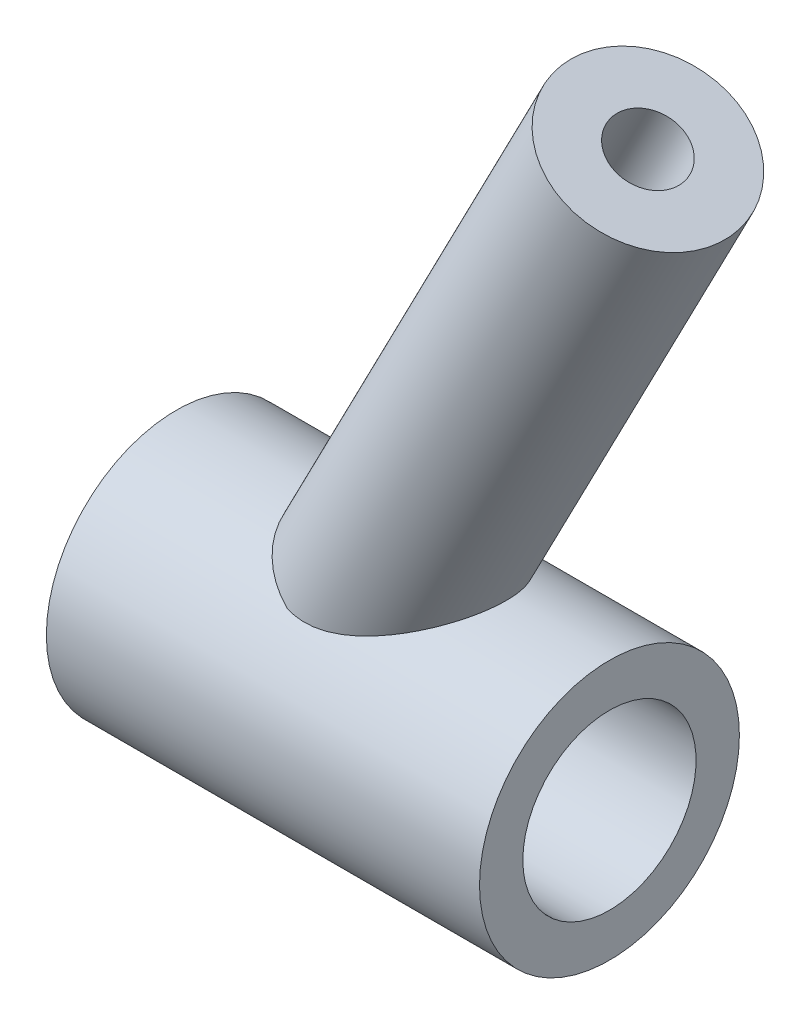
ISO-10303-21;
HEADER;
FILE_DESCRIPTION(('STEP AP214'),'2;1');
FILE_NAME('part.step','',(''),(''),'','','');
FILE_SCHEMA(('AUTOMOTIVE_DESIGN { 1 0 10303 214 1 1 1 1 }'));
ENDSEC;
DATA;
#1=APPLICATION_CONTEXT('core data for automotive mechanical design processes');
#2=APPLICATION_PROTOCOL_DEFINITION('international standard','automotive_design',2000,#1);
#3=PRODUCT_CONTEXT('',#1,'mechanical');
#4=PRODUCT('Part','Part','',(#3));
#5=PRODUCT_RELATED_PRODUCT_CATEGORY('part','',(#4));
#6=PRODUCT_DEFINITION_FORMATION('','',#4);
#7=PRODUCT_DEFINITION_CONTEXT('part definition',#1,'design');
#8=PRODUCT_DEFINITION('design','',#6,#7);
#9=PRODUCT_DEFINITION_SHAPE('','',#8);
#10=(LENGTH_UNIT() NAMED_UNIT(*) SI_UNIT(.MILLI.,.METRE.));
#11=(NAMED_UNIT(*) PLANE_ANGLE_UNIT() SI_UNIT($,.RADIAN.));
#12=(NAMED_UNIT(*) SI_UNIT($,.STERADIAN.) SOLID_ANGLE_UNIT());
#13=UNCERTAINTY_MEASURE_WITH_UNIT(LENGTH_MEASURE(1.E-05),#10,'distance_accuracy_value','');
#14=(GEOMETRIC_REPRESENTATION_CONTEXT(3) GLOBAL_UNCERTAINTY_ASSIGNED_CONTEXT((#13)) GLOBAL_UNIT_ASSIGNED_CONTEXT((#10,
#11,#12)) REPRESENTATION_CONTEXT('',''));
#15=CARTESIAN_POINT('',(0.,0.,0.));
#16=DIRECTION('',(0.,0.,1.));
#17=DIRECTION('',(1.,0.,0.));
#18=AXIS2_PLACEMENT_3D('',#15,#16,#17);
#19=CARTESIAN_POINT('',(0.,0.,0.));
#20=DIRECTION('',(-1.,0.,0.));
#21=DIRECTION('',(0.,0.,1.));
#22=AXIS2_PLACEMENT_3D('',#19,#20,#21);
#23=CYLINDRICAL_SURFACE('',#22,1.);
#24=CARTESIAN_POINT('',(1.90391969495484,0.,0.));
#25=DIRECTION('',(-0.519513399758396,0.854462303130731,0.));
#26=DIRECTION('',(-0.854462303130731,-0.519513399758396,0.));
#27=AXIS2_PLACEMENT_3D('',#24,#25,#26);
#28=ELLIPSE('',#27,1.92487816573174,1.);
#29=CARTESIAN_POINT('',(3.07510411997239,0.712080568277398,0.702097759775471));
#30=VERTEX_POINT('',#29);
#31=CARTESIAN_POINT('',(3.07510411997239,0.712080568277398,-0.702097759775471));
#32=VERTEX_POINT('',#31);
#33=EDGE_CURVE('E74',#30,#32,#28,.T.);
#34=ORIENTED_EDGE('',*,*,#33,.T.);
#35=CARTESIAN_POINT('',(4.44880184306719,0.,0.));
#36=DIRECTION('',(-0.460211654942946,-0.88780923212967,0.));
#37=DIRECTION('',(-0.88780923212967,0.460211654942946,0.));
#38=AXIS2_PLACEMENT_3D('',#35,#36,#37);
#39=ELLIPSE('',#38,2.17291324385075,1.);
#40=EDGE_CURVE('E133',#32,#30,#39,.F.);
#41=ORIENTED_EDGE('',*,*,#40,.T.);
#42=EDGE_LOOP('',(#34,#41));
#43=FACE_BOUND('',#42,.T.);
#44=CARTESIAN_POINT('',(5.,0.,0.));
#45=DIRECTION('',(-1.,0.,0.));
#46=DIRECTION('',(0.,0.,1.));
#47=AXIS2_PLACEMENT_3D('',#44,#45,#46);
#48=CIRCLE('',#47,1.);
#49=CARTESIAN_POINT('',(5.,0.,1.));
#50=VERTEX_POINT('',#49);
#51=EDGE_CURVE('E123',#50,#50,#48,.T.);
#52=ORIENTED_EDGE('',*,*,#51,.F.);
#53=EDGE_LOOP('',(#52));
#54=FACE_BOUND('',#53,.T.);
#55=CARTESIAN_POINT('',(0.,0.,0.));
#56=DIRECTION('',(-1.,0.,0.));
#57=DIRECTION('',(0.,0.,1.));
#58=AXIS2_PLACEMENT_3D('',#55,#56,#57);
#59=CIRCLE('',#58,0.999999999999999);
#60=CARTESIAN_POINT('',(0.,0.,0.999999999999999));
#61=VERTEX_POINT('',#60);
#62=EDGE_CURVE('E77',#61,#61,#59,.T.);
#63=ORIENTED_EDGE('',*,*,#62,.T.);
#64=EDGE_LOOP('',(#63));
#65=FACE_BOUND('',#64,.T.);
#66=ADVANCED_FACE('F32',(#43,#54,#65),#23,.F.);
#67=CARTESIAN_POINT('',(0.,0.999999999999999,0.));
#68=DIRECTION('',(1.,0.,0.));
#69=DIRECTION('',(0.,0.,-1.));
#70=AXIS2_PLACEMENT_3D('',#67,#68,#69);
#71=PLANE('',#70);
#72=ORIENTED_EDGE('',*,*,#62,.F.);
#73=EDGE_LOOP('',(#72));
#74=FACE_BOUND('',#73,.T.);
#75=CARTESIAN_POINT('',(0.,0.,0.));
#76=DIRECTION('',(-1.,0.,0.));
#77=DIRECTION('',(0.,0.,1.));
#78=AXIS2_PLACEMENT_3D('',#75,#76,#77);
#79=CIRCLE('',#78,1.5);
#80=CARTESIAN_POINT('',(0.,0.,1.5));
#81=VERTEX_POINT('',#80);
#82=EDGE_CURVE('E79',#81,#81,#79,.T.);
#83=ORIENTED_EDGE('',*,*,#82,.T.);
#84=EDGE_LOOP('',(#83));
#85=FACE_BOUND('',#84,.T.);
#86=ADVANCED_FACE('F108',(#74,#85),#71,.F.);
#87=CARTESIAN_POINT('',(0.,0.,0.));
#88=DIRECTION('',(-1.,0.,0.));
#89=DIRECTION('',(0.,0.,1.));
#90=AXIS2_PLACEMENT_3D('',#87,#88,#89);
#91=CYLINDRICAL_SURFACE('',#90,1.5);
#92=CARTESIAN_POINT('',(4.44880184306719,0.,0.));
#93=DIRECTION('',(-0.460211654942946,-0.88780923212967,0.));
#94=DIRECTION('',(-0.88780923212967,0.460211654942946,0.));
#95=AXIS2_PLACEMENT_3D('',#92,#93,#94);
#96=ELLIPSE('',#95,3.25936986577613,1.5);
#97=CARTESIAN_POINT('',(2.25273620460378,1.1383695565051,0.976787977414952));
#98=VERTEX_POINT('',#97);
#99=CARTESIAN_POINT('',(1.5551031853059,1.5,0.));
#100=VERTEX_POINT('',#99);
#101=EDGE_CURVE('E35',#98,#100,#96,.T.);
#102=ORIENTED_EDGE('',*,*,#101,.T.);
#103=CARTESIAN_POINT('',(2.25273620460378,1.1383695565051,-0.976787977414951));
#104=VERTEX_POINT('',#103);
#105=EDGE_CURVE('E11',#100,#104,#96,.T.);
#106=ORIENTED_EDGE('',*,*,#105,.T.);
#107=CARTESIAN_POINT('',(2.25273620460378,1.1383695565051,-0.976787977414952));
#108=CARTESIAN_POINT('',(2.27961917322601,1.13343787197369,-0.982523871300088));
#109=CARTESIAN_POINT('',(2.30688108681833,1.12941772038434,-0.98713381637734));
#110=CARTESIAN_POINT('',(2.36182423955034,1.12317956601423,-0.994230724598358));
#111=CARTESIAN_POINT('',(2.38950442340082,1.12095761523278,-0.996722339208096));
#112=CARTESIAN_POINT('',(2.47198384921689,1.11697313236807,-1.00119532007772));
#113=CARTESIAN_POINT('',(2.52707302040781,1.11774171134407,-1.00034316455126));
#114=CARTESIAN_POINT('',(2.65318723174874,1.12598788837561,-0.991057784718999));
#115=CARTESIAN_POINT('',(2.72387890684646,1.13546435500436,-0.980364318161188));
#116=CARTESIAN_POINT('',(2.86267198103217,1.16081177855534,-0.950209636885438));
#117=CARTESIAN_POINT('',(2.93074619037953,1.17673651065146,-0.930674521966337));
#118=CARTESIAN_POINT('',(3.03995402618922,1.20612245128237,-0.891984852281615));
#119=CARTESIAN_POINT('',(3.08220300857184,1.21850571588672,-0.875073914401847));
#120=CARTESIAN_POINT('',(3.16493883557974,1.24431243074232,-0.837972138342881));
#121=CARTESIAN_POINT('',(3.20542487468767,1.25773634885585,-0.817779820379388));
#122=CARTESIAN_POINT('',(3.28423067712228,1.28506346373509,-0.774127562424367));
#123=CARTESIAN_POINT('',(3.32255743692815,1.29896484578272,-0.750679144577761));
#124=CARTESIAN_POINT('',(3.39680303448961,1.3268034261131,-0.700300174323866));
#125=CARTESIAN_POINT('',(3.43272367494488,1.34074058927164,-0.673372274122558));
#126=CARTESIAN_POINT('',(3.50672327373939,1.37017810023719,-0.611517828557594));
#127=CARTESIAN_POINT('',(3.54434163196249,1.38560656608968,-0.575997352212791));
#128=CARTESIAN_POINT('',(3.61442243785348,1.41493989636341,-0.499613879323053));
#129=CARTESIAN_POINT('',(3.64689159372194,1.42884673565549,-0.458757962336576));
#130=CARTESIAN_POINT('',(3.69854371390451,1.45127516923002,-0.380880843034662));
#131=CARTESIAN_POINT('',(3.71908262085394,1.4603120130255,-0.344917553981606));
#132=CARTESIAN_POINT('',(3.75453971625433,1.47602721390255,-0.269827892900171));
#133=CARTESIAN_POINT('',(3.76946597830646,1.48270895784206,-0.230706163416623));
#134=CARTESIAN_POINT('',(3.79064763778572,1.49222671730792,-0.156330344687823));
#135=CARTESIAN_POINT('',(3.79788766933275,1.49549796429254,-0.121415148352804));
#136=CARTESIAN_POINT('',(3.80686687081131,1.49955819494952,-0.0507435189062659));
#137=CARTESIAN_POINT('',(3.80860938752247,1.50034868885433,-0.0149876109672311));
#138=CARTESIAN_POINT('',(3.80644062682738,1.49936654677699,0.0563216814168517));
#139=CARTESIAN_POINT('',(3.80252794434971,1.49759327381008,0.0918750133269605));
#140=CARTESIAN_POINT('',(3.78939101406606,1.49166409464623,0.161779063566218));
#141=CARTESIAN_POINT('',(3.78016277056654,1.48750639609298,0.196128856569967));
#142=CARTESIAN_POINT('',(3.75396126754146,1.47577693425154,0.271882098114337));
#143=CARTESIAN_POINT('',(3.73557224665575,1.46758759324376,0.312696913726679));
#144=CARTESIAN_POINT('',(3.69293370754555,1.44882803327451,0.390524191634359));
#145=CARTESIAN_POINT('',(3.66867374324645,1.43825357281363,0.427529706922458));
#146=CARTESIAN_POINT('',(3.60323436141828,1.4101823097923,0.51412639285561));
#147=CARTESIAN_POINT('',(3.55946481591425,1.39176943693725,0.56144704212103));
#148=CARTESIAN_POINT('',(3.46530962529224,1.35349037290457,0.648325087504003));
#149=CARTESIAN_POINT('',(3.41490551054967,1.33362019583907,0.68786001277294));
#150=CARTESIAN_POINT('',(3.32482174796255,1.29979435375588,0.74924729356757));
#151=CARTESIAN_POINT('',(3.28634102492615,1.28581585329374,0.772882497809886));
#152=CARTESIAN_POINT('',(3.20731035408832,1.25837052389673,0.81680793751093));
#153=CARTESIAN_POINT('',(3.16675927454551,1.24490398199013,0.83709631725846));
#154=CARTESIAN_POINT('',(3.08385572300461,1.21899848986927,0.874389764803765));
#155=CARTESIAN_POINT('',(3.04150315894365,1.20655959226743,0.891394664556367));
#156=CARTESIAN_POINT('',(2.95520035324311,1.18329699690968,0.922051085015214));
#157=CARTESIAN_POINT('',(2.91125114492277,1.17247227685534,0.935704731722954));
#158=CARTESIAN_POINT('',(2.81126289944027,1.15081591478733,0.962279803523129));
#159=CARTESIAN_POINT('',(2.75483080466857,1.14059278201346,0.974257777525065));
#160=CARTESIAN_POINT('',(2.64053509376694,1.12533031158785,0.991853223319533));
#161=CARTESIAN_POINT('',(2.58268128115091,1.12026222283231,0.99750599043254));
#162=CARTESIAN_POINT('',(2.47908123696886,1.11733525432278,1.00078268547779));
#163=CARTESIAN_POINT('',(2.43343473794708,1.11814955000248,0.999883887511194));
#164=CARTESIAN_POINT('',(2.36531721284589,1.12296140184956,0.994465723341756));
#165=CARTESIAN_POINT('',(2.34254819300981,1.12518565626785,0.991956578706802));
#166=CARTESIAN_POINT('',(2.29734436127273,1.13085778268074,0.985483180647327));
#167=CARTESIAN_POINT('',(2.27490999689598,1.13430716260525,0.981517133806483));
#168=CARTESIAN_POINT('',(2.25273620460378,1.1383695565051,0.976787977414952));
#169=B_SPLINE_CURVE_WITH_KNOTS('',3,(#107,#108,#109,#110,#111,#112,#113,#114,#115,#116,#117,
#118,#119,#120,#121,#122,#123,#124,#125,#126,#127,#128,#129,#130,#131,#132,#133,#134,#135,#136,
#137,#138,#139,#140,#141,#142,#143,#144,#145,#146,#147,#148,#149,#150,#151,#152,#153,#154,#155,
#156,#157,#158,#159,#160,#161,#162,#163,#164,#165,#166,#167,#168),.UNSPECIFIED.,.F.,.F.,(4,2,2,
2,2,2,2,2,2,2,2,2,2,2,2,2,2,2,2,2,2,2,2,2,2,2,2,2,2,2,4),(0.,0.0836967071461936,
0.16720915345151,0.331638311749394,0.54685409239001,0.763902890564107,0.905250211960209,
1.04666145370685,1.18758447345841,1.32840070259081,1.48994477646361,1.65127663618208,
1.77799493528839,1.90453025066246,2.01147593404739,2.11835649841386,2.22526362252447,
2.33225121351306,2.46802296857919,2.60403809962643,2.80404927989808,3.00462952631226,
3.14629024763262,3.28802925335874,3.42977551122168,3.57143161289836,3.74671921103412,
3.92102373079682,4.05746667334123,4.12643654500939,4.19549160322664),.UNSPECIFIED.);
#170=EDGE_CURVE('E69',#104,#98,#169,.T.);
#171=ORIENTED_EDGE('',*,*,#170,.T.);
#172=EDGE_LOOP('',(#102,#106,#171));
#173=FACE_BOUND('',#172,.T.);
#174=ORIENTED_EDGE('',*,*,#82,.F.);
#175=EDGE_LOOP('',(#174));
#176=FACE_BOUND('',#175,.T.);
#177=CARTESIAN_POINT('',(5.,0.,0.));
#178=DIRECTION('',(-1.,0.,0.));
#179=DIRECTION('',(0.,0.,1.));
#180=AXIS2_PLACEMENT_3D('',#177,#178,#179);
#181=CIRCLE('',#180,1.5);
#182=CARTESIAN_POINT('',(5.,0.,1.5));
#183=VERTEX_POINT('',#182);
#184=EDGE_CURVE('E128',#183,#183,#181,.T.);
#185=ORIENTED_EDGE('',*,*,#184,.T.);
#186=EDGE_LOOP('',(#185));
#187=FACE_BOUND('',#186,.T.);
#188=ADVANCED_FACE('F75',(#173,#176,#187),#91,.T.);
#189=CARTESIAN_POINT('',(5.,1.5,0.));
#190=DIRECTION('',(-1.,0.,0.));
#191=DIRECTION('',(0.,0.,1.));
#192=AXIS2_PLACEMENT_3D('',#189,#190,#191);
#193=PLANE('',#192);
#194=ORIENTED_EDGE('',*,*,#184,.F.);
#195=EDGE_LOOP('',(#194));
#196=FACE_BOUND('',#195,.T.);
#197=ORIENTED_EDGE('',*,*,#51,.T.);
#198=EDGE_LOOP('',(#197));
#199=FACE_BOUND('',#198,.T.);
#200=ADVANCED_FACE('F100',(#196,#199),#193,.F.);
#201=CARTESIAN_POINT('',(4.55609538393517,7.28931139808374,0.));
#202=DIRECTION('',(0.460211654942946,0.88780923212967,0.));
#203=DIRECTION('',(-0.88780923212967,0.460211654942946,0.));
#204=AXIS2_PLACEMENT_3D('',#201,#202,#203);
#205=PLANE('',#204);
#206=CARTESIAN_POINT('',(5.44390461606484,6.82909974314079,0.));
#207=DIRECTION('',(0.460211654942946,0.88780923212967,0.));
#208=DIRECTION('',(-0.88780923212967,0.460211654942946,0.));
#209=AXIS2_PLACEMENT_3D('',#206,#207,#208);
#210=CIRCLE('',#209,0.4);
#211=CARTESIAN_POINT('',(5.08878092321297,7.01318440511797,0.));
#212=VERTEX_POINT('',#211);
#213=EDGE_CURVE('E139',#212,#212,#210,.T.);
#214=ORIENTED_EDGE('',*,*,#213,.F.);
#215=EDGE_LOOP('',(#214));
#216=FACE_BOUND('',#215,.T.);
#217=CARTESIAN_POINT('',(5.44390461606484,6.82909974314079,0.));
#218=DIRECTION('',(0.460211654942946,0.88780923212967,0.));
#219=DIRECTION('',(-0.88780923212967,0.460211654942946,0.));
#220=AXIS2_PLACEMENT_3D('',#217,#218,#219);
#221=CIRCLE('',#220,1.);
#222=CARTESIAN_POINT('',(4.55609538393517,7.28931139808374,0.));
#223=VERTEX_POINT('',#222);
#224=EDGE_CURVE('E70',#223,#223,#221,.T.);
#225=ORIENTED_EDGE('',*,*,#224,.T.);
#226=EDGE_LOOP('',(#225));
#227=FACE_BOUND('',#226,.T.);
#228=ADVANCED_FACE('F96',(#216,#227),#205,.T.);
#229=CARTESIAN_POINT('',(5.44390461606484,6.82909974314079,0.));
#230=DIRECTION('',(0.460211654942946,0.88780923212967,0.));
#231=DIRECTION('',(-0.88780923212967,0.460211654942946,0.));
#232=AXIS2_PLACEMENT_3D('',#229,#230,#231);
#233=CYLINDRICAL_SURFACE('',#232,1.);
#234=ORIENTED_EDGE('',*,*,#224,.F.);
#235=EDGE_LOOP('',(#234));
#236=FACE_BOUND('',#235,.T.);
#237=ORIENTED_EDGE('',*,*,#170,.F.);
#238=CARTESIAN_POINT('',(2.44291241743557,1.03978834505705,0.));
#239=DIRECTION('',(0.460211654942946,0.88780923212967,0.));
#240=DIRECTION('',(-0.88780923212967,0.460211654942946,0.));
#241=AXIS2_PLACEMENT_3D('',#238,#239,#240);
#242=CIRCLE('',#241,0.999999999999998);
#243=EDGE_CURVE('E64',#104,#100,#242,.T.);
#244=ORIENTED_EDGE('',*,*,#243,.T.);
#245=EDGE_CURVE('E53',#100,#98,#242,.T.);
#246=ORIENTED_EDGE('',*,*,#245,.T.);
#247=EDGE_LOOP('',(#237,#244,#246));
#248=FACE_BOUND('',#247,.T.);
#249=ADVANCED_FACE('F68',(#236,#248),#233,.T.);
#250=CARTESIAN_POINT('',(2.44291241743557,1.03978834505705,0.));
#251=DIRECTION('',(-0.460211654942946,-0.88780923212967,0.));
#252=DIRECTION('',(0.88780923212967,-0.460211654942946,0.));
#253=AXIS2_PLACEMENT_3D('',#250,#251,#252);
#254=PLANE('',#253);
#255=ORIENTED_EDGE('',*,*,#101,.F.);
#256=ORIENTED_EDGE('',*,*,#245,.F.);
#257=EDGE_LOOP('',(#255,#256));
#258=FACE_BOUND('',#257,.T.);
#259=ADVANCED_FACE('F73',(#258),#254,.T.);
#260=ORIENTED_EDGE('',*,*,#105,.F.);
#261=ORIENTED_EDGE('',*,*,#243,.F.);
#262=EDGE_LOOP('',(#260,#261));
#263=FACE_BOUND('',#262,.T.);
#264=ADVANCED_FACE('F63',(#263),#254,.T.);
#265=ORIENTED_EDGE('',*,*,#40,.F.);
#266=EDGE_CURVE('E45',#30,#32,#242,.T.);
#267=ORIENTED_EDGE('',*,*,#266,.F.);
#268=EDGE_LOOP('',(#265,#267));
#269=FACE_BOUND('',#268,.T.);
#270=ADVANCED_FACE('F95',(#269),#254,.T.);
#271=ORIENTED_EDGE('',*,*,#33,.F.);
#272=ORIENTED_EDGE('',*,*,#266,.T.);
#273=EDGE_LOOP('',(#271,#272));
#274=FACE_BOUND('',#273,.T.);
#275=ADVANCED_FACE('F89',(#274),#233,.T.);
#276=CARTESIAN_POINT('',(2.45252885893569,1.05833973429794,0.));
#277=DIRECTION('',(0.460211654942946,0.88780923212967,0.));
#278=DIRECTION('',(-0.88780923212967,0.460211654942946,0.));
#279=AXIS2_PLACEMENT_3D('',#276,#277,#278);
#280=CYLINDRICAL_SURFACE('',#279,0.4);
#281=CARTESIAN_POINT('',(2.45252885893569,1.05833973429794,0.));
#282=DIRECTION('',(0.460211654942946,0.88780923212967,0.));
#283=DIRECTION('',(-0.88780923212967,0.460211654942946,0.));
#284=AXIS2_PLACEMENT_3D('',#281,#282,#283);
#285=CIRCLE('',#284,0.4);
#286=CARTESIAN_POINT('',(2.09740516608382,1.24242439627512,0.));
#287=VERTEX_POINT('',#286);
#288=EDGE_CURVE('E138',#287,#287,#285,.T.);
#289=ORIENTED_EDGE('',*,*,#288,.F.);
#290=EDGE_LOOP('',(#289));
#291=FACE_BOUND('',#290,.T.);
#292=ORIENTED_EDGE('',*,*,#213,.T.);
#293=EDGE_LOOP('',(#292));
#294=FACE_BOUND('',#293,.T.);
#295=ADVANCED_FACE('F94',(#291,#294),#280,.F.);
#296=CARTESIAN_POINT('',(2.45252885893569,1.05833973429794,0.));
#297=DIRECTION('',(0.460211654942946,0.88780923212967,0.));
#298=DIRECTION('',(-0.88780923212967,0.460211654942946,0.));
#299=AXIS2_PLACEMENT_3D('',#296,#297,#298);
#300=PLANE('',#299);
#301=ORIENTED_EDGE('',*,*,#288,.T.);
#302=EDGE_LOOP('',(#301));
#303=FACE_BOUND('',#302,.T.);
#304=ADVANCED_FACE('F145',(#303),#300,.T.);
#305=CLOSED_SHELL('',(#66,#86,#188,#200,#228,#249,#259,#264,#270,#275,#295,#304));
#306=MANIFOLD_SOLID_BREP('B2',#305);
#307=ADVANCED_BREP_SHAPE_REPRESENTATION('',(#18,#306),#14);
#308=SHAPE_DEFINITION_REPRESENTATION(#9,#307);
ENDSEC;
END-ISO-10303-21;
